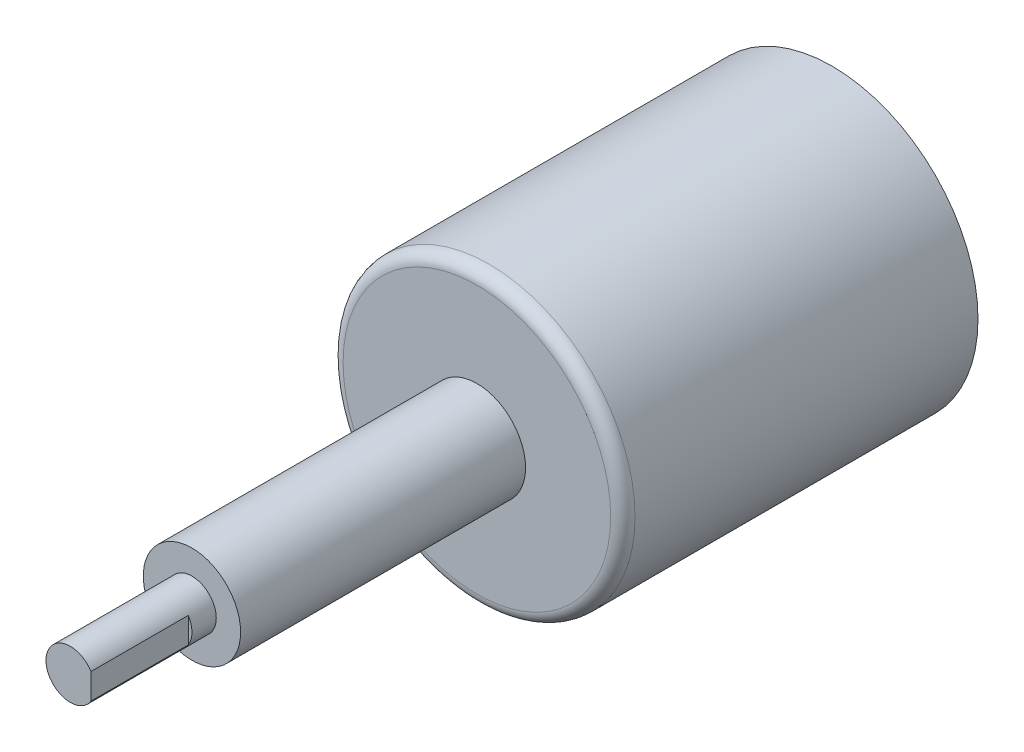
ISO-10303-21;
HEADER;
FILE_DESCRIPTION(('STEP AP214'),'2;1');
FILE_NAME('part.step','',(''),(''),'','','');
FILE_SCHEMA(('AUTOMOTIVE_DESIGN { 1 0 10303 214 1 1 1 1 }'));
ENDSEC;
DATA;
#1=APPLICATION_CONTEXT('core data for automotive mechanical design processes');
#2=APPLICATION_PROTOCOL_DEFINITION('international standard','automotive_design',2000,#1);
#3=PRODUCT_CONTEXT('',#1,'mechanical');
#4=PRODUCT('Part','Part','',(#3));
#5=PRODUCT_RELATED_PRODUCT_CATEGORY('part','',(#4));
#6=PRODUCT_DEFINITION_FORMATION('','',#4);
#7=PRODUCT_DEFINITION_CONTEXT('part definition',#1,'design');
#8=PRODUCT_DEFINITION('design','',#6,#7);
#9=PRODUCT_DEFINITION_SHAPE('','',#8);
#10=(LENGTH_UNIT() NAMED_UNIT(*) SI_UNIT(.MILLI.,.METRE.));
#11=(NAMED_UNIT(*) PLANE_ANGLE_UNIT() SI_UNIT($,.RADIAN.));
#12=(NAMED_UNIT(*) SI_UNIT($,.STERADIAN.) SOLID_ANGLE_UNIT());
#13=UNCERTAINTY_MEASURE_WITH_UNIT(LENGTH_MEASURE(1.E-05),#10,'distance_accuracy_value','');
#14=(GEOMETRIC_REPRESENTATION_CONTEXT(3) GLOBAL_UNCERTAINTY_ASSIGNED_CONTEXT((#13)) GLOBAL_UNIT_ASSIGNED_CONTEXT((#10,
#11,#12)) REPRESENTATION_CONTEXT('',''));
#15=CARTESIAN_POINT('',(0.,0.,0.));
#16=DIRECTION('',(0.,0.,1.));
#17=DIRECTION('',(1.,0.,0.));
#18=AXIS2_PLACEMENT_3D('',#15,#16,#17);
#19=CARTESIAN_POINT('',(0.,0.,52.63));
#20=DIRECTION('',(0.,0.,1.));
#21=DIRECTION('',(1.,0.,0.));
#22=AXIS2_PLACEMENT_3D('',#19,#20,#21);
#23=PLANE('',#22);
#24=CARTESIAN_POINT('',(0.,0.,52.63));
#25=DIRECTION('',(0.,0.,1.));
#26=DIRECTION('',(1.,0.,0.));
#27=AXIS2_PLACEMENT_3D('',#24,#25,#26);
#28=CIRCLE('',#27,4.);
#29=CARTESIAN_POINT('',(4.,0.,52.63));
#30=VERTEX_POINT('',#29);
#31=EDGE_CURVE('E69',#30,#30,#28,.T.);
#32=ORIENTED_EDGE('',*,*,#31,.T.);
#33=EDGE_LOOP('',(#32));
#34=FACE_BOUND('',#33,.T.);
#35=CARTESIAN_POINT('',(0.,0.,52.63));
#36=DIRECTION('',(0.,0.,1.));
#37=DIRECTION('',(1.,0.,0.));
#38=AXIS2_PLACEMENT_3D('',#35,#36,#37);
#39=CIRCLE('',#38,2.);
#40=CARTESIAN_POINT('',(2.,0.,52.63));
#41=VERTEX_POINT('',#40);
#42=EDGE_CURVE('E66',#41,#41,#39,.T.);
#43=ORIENTED_EDGE('',*,*,#42,.F.);
#44=EDGE_LOOP('',(#43));
#45=FACE_BOUND('',#44,.T.);
#46=ADVANCED_FACE('F27',(#34,#45),#23,.T.);
#47=CARTESIAN_POINT('',(0.,0.,29.2));
#48=DIRECTION('',(0.,0.,1.));
#49=DIRECTION('',(1.,0.,0.));
#50=AXIS2_PLACEMENT_3D('',#47,#48,#49);
#51=PLANE('',#50);
#52=CARTESIAN_POINT('',(0.,0.,29.2));
#53=DIRECTION('',(0.,0.,1.));
#54=DIRECTION('',(1.,0.,0.));
#55=AXIS2_PLACEMENT_3D('',#52,#53,#54);
#56=CIRCLE('',#55,11.);
#57=CARTESIAN_POINT('',(11.,0.,29.2));
#58=VERTEX_POINT('',#57);
#59=EDGE_CURVE('E80',#58,#58,#56,.T.);
#60=ORIENTED_EDGE('',*,*,#59,.T.);
#61=EDGE_LOOP('',(#60));
#62=FACE_BOUND('',#61,.T.);
#63=CARTESIAN_POINT('',(0.,0.,29.2));
#64=DIRECTION('',(0.,0.,1.));
#65=DIRECTION('',(1.,0.,0.));
#66=AXIS2_PLACEMENT_3D('',#63,#64,#65);
#67=CIRCLE('',#66,4.);
#68=CARTESIAN_POINT('',(4.,0.,29.2));
#69=VERTEX_POINT('',#68);
#70=EDGE_CURVE('E65',#69,#69,#67,.T.);
#71=ORIENTED_EDGE('',*,*,#70,.F.);
#72=EDGE_LOOP('',(#71));
#73=FACE_BOUND('',#72,.T.);
#74=ADVANCED_FACE('F96',(#62,#73),#51,.T.);
#75=CARTESIAN_POINT('',(0.,0.,29.2));
#76=DIRECTION('',(0.,0.,-1.));
#77=DIRECTION('',(-1.,0.,0.));
#78=AXIS2_PLACEMENT_3D('',#75,#76,#77);
#79=CYLINDRICAL_SURFACE('',#78,12.);
#80=CARTESIAN_POINT('',(0.,0.,28.2));
#81=DIRECTION('',(0.,0.,1.));
#82=DIRECTION('',(1.,0.,0.));
#83=AXIS2_PLACEMENT_3D('',#80,#81,#82);
#84=CIRCLE('',#83,12.);
#85=CARTESIAN_POINT('',(12.,0.,28.2));
#86=VERTEX_POINT('',#85);
#87=EDGE_CURVE('E57',#86,#86,#84,.F.);
#88=ORIENTED_EDGE('',*,*,#87,.T.);
#89=EDGE_LOOP('',(#88));
#90=FACE_BOUND('',#89,.T.);
#91=CARTESIAN_POINT('',(0.,0.,0.));
#92=DIRECTION('',(0.,0.,1.));
#93=DIRECTION('',(1.,0.,0.));
#94=AXIS2_PLACEMENT_3D('',#91,#92,#93);
#95=CIRCLE('',#94,12.);
#96=CARTESIAN_POINT('',(12.,0.,0.));
#97=VERTEX_POINT('',#96);
#98=EDGE_CURVE('E77',#97,#97,#95,.T.);
#99=ORIENTED_EDGE('',*,*,#98,.T.);
#100=EDGE_LOOP('',(#99));
#101=FACE_BOUND('',#100,.T.);
#102=ADVANCED_FACE('F29',(#90,#101),#79,.T.);
#103=CARTESIAN_POINT('',(0.,0.,0.));
#104=DIRECTION('',(0.,0.,1.));
#105=DIRECTION('',(1.,0.,0.));
#106=AXIS2_PLACEMENT_3D('',#103,#104,#105);
#107=PLANE('',#106);
#108=ORIENTED_EDGE('',*,*,#98,.F.);
#109=EDGE_LOOP('',(#108));
#110=FACE_BOUND('',#109,.T.);
#111=ADVANCED_FACE('F92',(#110),#107,.F.);
#112=CARTESIAN_POINT('',(0.,0.,28.2));
#113=DIRECTION('',(0.,0.,1.));
#114=DIRECTION('',(1.,0.,0.));
#115=AXIS2_PLACEMENT_3D('',#112,#113,#114);
#116=TOROIDAL_SURFACE('',#115,11.,1.);
#117=ORIENTED_EDGE('',*,*,#87,.F.);
#118=EDGE_LOOP('',(#117));
#119=FACE_BOUND('',#118,.T.);
#120=ORIENTED_EDGE('',*,*,#59,.F.);
#121=EDGE_LOOP('',(#120));
#122=FACE_BOUND('',#121,.T.);
#123=ADVANCED_FACE('F88',(#119,#122),#116,.T.);
#124=CARTESIAN_POINT('',(0.,0.,52.63));
#125=DIRECTION('',(0.,0.,-1.));
#126=DIRECTION('',(-1.,0.,0.));
#127=AXIS2_PLACEMENT_3D('',#124,#125,#126);
#128=CYLINDRICAL_SURFACE('',#127,4.);
#129=ORIENTED_EDGE('',*,*,#31,.F.);
#130=EDGE_LOOP('',(#129));
#131=FACE_BOUND('',#130,.T.);
#132=ORIENTED_EDGE('',*,*,#70,.T.);
#133=EDGE_LOOP('',(#132));
#134=FACE_BOUND('',#133,.T.);
#135=ADVANCED_FACE('F91',(#131,#134),#128,.T.);
#136=CARTESIAN_POINT('',(0.,0.,62.63));
#137=DIRECTION('',(0.,0.,-1.));
#138=DIRECTION('',(-1.,0.,0.));
#139=AXIS2_PLACEMENT_3D('',#136,#137,#138);
#140=CYLINDRICAL_SURFACE('',#139,2.);
#141=CARTESIAN_POINT('',(0.,0.,62.63));
#142=DIRECTION('',(0.,0.,1.));
#143=DIRECTION('',(1.,0.,0.));
#144=AXIS2_PLACEMENT_3D('',#141,#142,#143);
#145=CIRCLE('',#144,2.);
#146=CARTESIAN_POINT('',(1.7,1.05356537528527,62.63));
#147=VERTEX_POINT('',#146);
#148=CARTESIAN_POINT('',(1.7,-1.05356537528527,62.63));
#149=VERTEX_POINT('',#148);
#150=EDGE_CURVE('E61',#147,#149,#145,.T.);
#151=ORIENTED_EDGE('',*,*,#150,.F.);
#152=DIRECTION('',(0.,0.,-1.));
#153=VECTOR('',#152,1.);
#154=CARTESIAN_POINT('',(1.7,1.05356537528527,62.63));
#155=LINE('',#154,#153);
#156=CARTESIAN_POINT('',(1.7,1.05356537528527,54.63));
#157=VERTEX_POINT('',#156);
#158=EDGE_CURVE('E42',#147,#157,#155,.T.);
#159=ORIENTED_EDGE('',*,*,#158,.T.);
#160=CARTESIAN_POINT('',(0.,0.,54.63));
#161=DIRECTION('',(0.,0.,-1.));
#162=DIRECTION('',(-1.,0.,0.));
#163=AXIS2_PLACEMENT_3D('',#160,#161,#162);
#164=CIRCLE('',#163,2.);
#165=CARTESIAN_POINT('',(1.7,-1.05356537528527,54.63));
#166=VERTEX_POINT('',#165);
#167=EDGE_CURVE('E11',#157,#166,#164,.T.);
#168=ORIENTED_EDGE('',*,*,#167,.T.);
#169=DIRECTION('',(0.,0.,-1.));
#170=VECTOR('',#169,1.);
#171=CARTESIAN_POINT('',(1.7,-1.05356537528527,62.63));
#172=LINE('',#171,#170);
#173=EDGE_CURVE('E47',#166,#149,#172,.F.);
#174=ORIENTED_EDGE('',*,*,#173,.T.);
#175=EDGE_LOOP('',(#151,#159,#168,#174));
#176=FACE_BOUND('',#175,.T.);
#177=ORIENTED_EDGE('',*,*,#42,.T.);
#178=EDGE_LOOP('',(#177));
#179=FACE_BOUND('',#178,.T.);
#180=ADVANCED_FACE('F59',(#176,#179),#140,.T.);
#181=CARTESIAN_POINT('',(0.,0.,62.63));
#182=DIRECTION('',(0.,0.,1.));
#183=DIRECTION('',(1.,0.,0.));
#184=AXIS2_PLACEMENT_3D('',#181,#182,#183);
#185=PLANE('',#184);
#186=DIRECTION('',(0.,-1.,0.));
#187=VECTOR('',#186,1.);
#188=CARTESIAN_POINT('',(1.7,0.,62.63));
#189=LINE('',#188,#187);
#190=EDGE_CURVE('E35',#147,#149,#189,.T.);
#191=ORIENTED_EDGE('',*,*,#190,.F.);
#192=ORIENTED_EDGE('',*,*,#150,.T.);
#193=EDGE_LOOP('',(#191,#192));
#194=FACE_BOUND('',#193,.T.);
#195=ADVANCED_FACE('F64',(#194),#185,.T.);
#196=CARTESIAN_POINT('',(4.16498599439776,-4.36974789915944,54.63));
#197=DIRECTION('',(0.,0.,-1.));
#198=DIRECTION('',(-1.,0.,0.));
#199=AXIS2_PLACEMENT_3D('',#196,#197,#198);
#200=PLANE('',#199);
#201=DIRECTION('',(0.,-1.,0.));
#202=VECTOR('',#201,1.);
#203=CARTESIAN_POINT('',(1.7,3.80952380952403,54.63));
#204=LINE('',#203,#202);
#205=EDGE_CURVE('E62',#157,#166,#204,.T.);
#206=ORIENTED_EDGE('',*,*,#205,.T.);
#207=ORIENTED_EDGE('',*,*,#167,.F.);
#208=EDGE_LOOP('',(#206,#207));
#209=FACE_BOUND('',#208,.T.);
#210=ADVANCED_FACE('F118',(#209),#200,.F.);
#211=CARTESIAN_POINT('',(1.7,3.80952380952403,54.63));
#212=DIRECTION('',(-1.,0.,0.));
#213=DIRECTION('',(0.,-1.,0.));
#214=AXIS2_PLACEMENT_3D('',#211,#212,#213);
#215=PLANE('',#214);
#216=ORIENTED_EDGE('',*,*,#190,.T.);
#217=ORIENTED_EDGE('',*,*,#173,.F.);
#218=ORIENTED_EDGE('',*,*,#205,.F.);
#219=ORIENTED_EDGE('',*,*,#158,.F.);
#220=EDGE_LOOP('',(#216,#217,#218,#219));
#221=FACE_BOUND('',#220,.T.);
#222=ADVANCED_FACE('F53',(#221),#215,.F.);
#223=CLOSED_SHELL('',(#46,#74,#102,#111,#123,#135,#180,#195,#210,#222));
#224=MANIFOLD_SOLID_BREP('B2',#223);
#225=ADVANCED_BREP_SHAPE_REPRESENTATION('',(#18,#224),#14);
#226=SHAPE_DEFINITION_REPRESENTATION(#9,#225);
ENDSEC;
END-ISO-10303-21;
